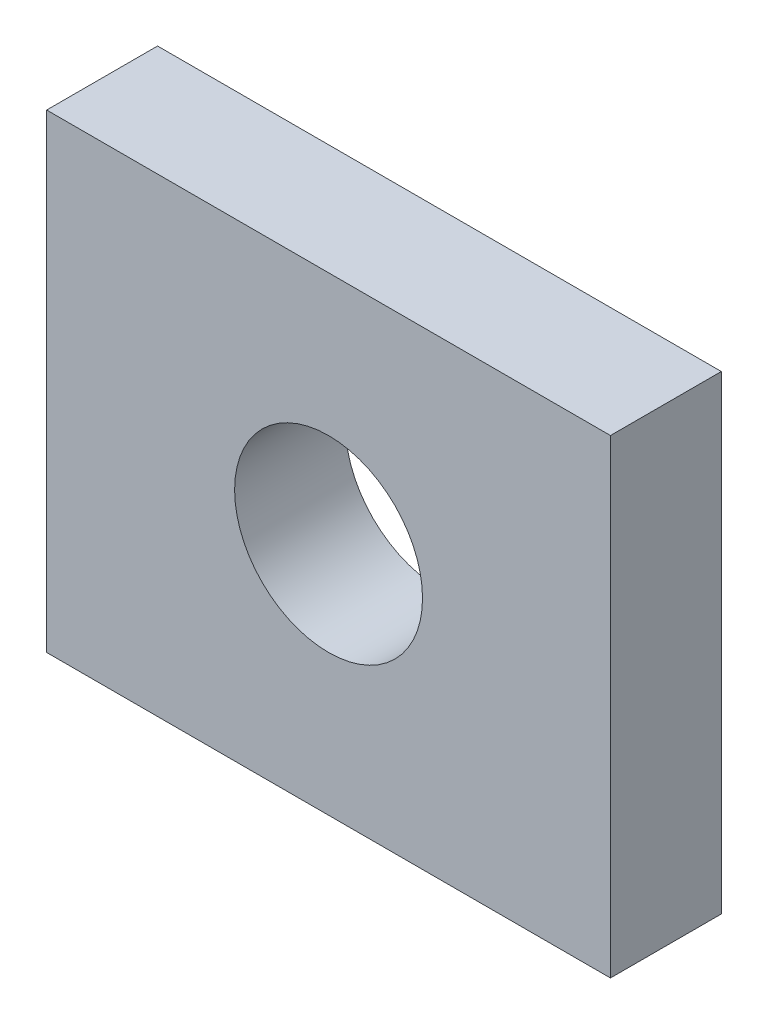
ISO-10303-21;
HEADER;
FILE_DESCRIPTION(('STEP AP214'),'2;1');
FILE_NAME('part.step','',(''),(''),'','','');
FILE_SCHEMA(('AUTOMOTIVE_DESIGN { 1 0 10303 214 1 1 1 1 }'));
ENDSEC;
DATA;
#1=APPLICATION_CONTEXT('core data for automotive mechanical design processes');
#2=APPLICATION_PROTOCOL_DEFINITION('international standard','automotive_design',2000,#1);
#3=PRODUCT_CONTEXT('',#1,'mechanical');
#4=PRODUCT('Part','Part','',(#3));
#5=PRODUCT_RELATED_PRODUCT_CATEGORY('part','',(#4));
#6=PRODUCT_DEFINITION_FORMATION('','',#4);
#7=PRODUCT_DEFINITION_CONTEXT('part definition',#1,'design');
#8=PRODUCT_DEFINITION('design','',#6,#7);
#9=PRODUCT_DEFINITION_SHAPE('','',#8);
#10=(LENGTH_UNIT() NAMED_UNIT(*) SI_UNIT(.MILLI.,.METRE.));
#11=(NAMED_UNIT(*) PLANE_ANGLE_UNIT() SI_UNIT($,.RADIAN.));
#12=(NAMED_UNIT(*) SI_UNIT($,.STERADIAN.) SOLID_ANGLE_UNIT());
#13=UNCERTAINTY_MEASURE_WITH_UNIT(LENGTH_MEASURE(1.E-05),#10,'distance_accuracy_value','');
#14=(GEOMETRIC_REPRESENTATION_CONTEXT(3) GLOBAL_UNCERTAINTY_ASSIGNED_CONTEXT((#13)) GLOBAL_UNIT_ASSIGNED_CONTEXT((#10,
#11,#12)) REPRESENTATION_CONTEXT('',''));
#15=CARTESIAN_POINT('',(0.,0.,0.));
#16=DIRECTION('',(0.,0.,1.));
#17=DIRECTION('',(1.,0.,0.));
#18=AXIS2_PLACEMENT_3D('',#15,#16,#17);
#19=CARTESIAN_POINT('',(0.,0.,2.9972));
#20=DIRECTION('',(0.,0.,-1.));
#21=DIRECTION('',(-1.,0.,0.));
#22=AXIS2_PLACEMENT_3D('',#19,#20,#21);
#23=PLANE('',#22);
#24=DIRECTION('',(0.,-1.,0.));
#25=VECTOR('',#24,1.);
#26=CARTESIAN_POINT('',(0.,0.,2.9972));
#27=LINE('',#26,#25);
#28=CARTESIAN_POINT('',(0.,12.7,2.9972));
#29=VERTEX_POINT('',#28);
#30=CARTESIAN_POINT('',(0.,0.,2.9972));
#31=VERTEX_POINT('',#30);
#32=EDGE_CURVE('E85',#29,#31,#27,.T.);
#33=ORIENTED_EDGE('',*,*,#32,.T.);
#34=DIRECTION('',(1.,0.,0.));
#35=VECTOR('',#34,1.);
#36=CARTESIAN_POINT('',(0.,0.,2.9972));
#37=LINE('',#36,#35);
#38=CARTESIAN_POINT('',(15.24,0.,2.9972));
#39=VERTEX_POINT('',#38);
#40=EDGE_CURVE('E80',#31,#39,#37,.T.);
#41=ORIENTED_EDGE('',*,*,#40,.T.);
#42=DIRECTION('',(0.,1.,0.));
#43=VECTOR('',#42,1.);
#44=CARTESIAN_POINT('',(15.24,0.,2.9972));
#45=LINE('',#44,#43);
#46=CARTESIAN_POINT('',(15.24,12.7,2.9972));
#47=VERTEX_POINT('',#46);
#48=EDGE_CURVE('E83',#39,#47,#45,.T.);
#49=ORIENTED_EDGE('',*,*,#48,.T.);
#50=DIRECTION('',(-1.,0.,0.));
#51=VECTOR('',#50,1.);
#52=CARTESIAN_POINT('',(0.,12.7,2.9972));
#53=LINE('',#52,#51);
#54=EDGE_CURVE('E50',#47,#29,#53,.T.);
#55=ORIENTED_EDGE('',*,*,#54,.T.);
#56=EDGE_LOOP('',(#33,#41,#49,#55));
#57=FACE_BOUND('',#56,.T.);
#58=CARTESIAN_POINT('',(7.62,6.35,2.9972));
#59=DIRECTION('',(0.,0.,1.));
#60=DIRECTION('',(1.,0.,0.));
#61=AXIS2_PLACEMENT_3D('',#58,#59,#60);
#62=CIRCLE('',#61,2.54);
#63=CARTESIAN_POINT('',(5.08,6.35,2.9972));
#64=VERTEX_POINT('',#63);
#65=EDGE_CURVE('E100',#64,#64,#62,.T.);
#66=ORIENTED_EDGE('',*,*,#65,.F.);
#67=EDGE_LOOP('',(#66));
#68=FACE_BOUND('',#67,.T.);
#69=ADVANCED_FACE('F33',(#57,#68),#23,.F.);
#70=CARTESIAN_POINT('',(0.,0.,0.));
#71=DIRECTION('',(0.,0.,-1.));
#72=DIRECTION('',(-1.,0.,0.));
#73=AXIS2_PLACEMENT_3D('',#70,#71,#72);
#74=PLANE('',#73);
#75=DIRECTION('',(0.,-1.,0.));
#76=VECTOR('',#75,1.);
#77=CARTESIAN_POINT('',(0.,0.,0.));
#78=LINE('',#77,#76);
#79=CARTESIAN_POINT('',(0.,12.7,0.));
#80=VERTEX_POINT('',#79);
#81=CARTESIAN_POINT('',(0.,0.,0.));
#82=VERTEX_POINT('',#81);
#83=EDGE_CURVE('E97',#80,#82,#78,.T.);
#84=ORIENTED_EDGE('',*,*,#83,.F.);
#85=DIRECTION('',(-1.,0.,0.));
#86=VECTOR('',#85,1.);
#87=CARTESIAN_POINT('',(0.,12.7,0.));
#88=LINE('',#87,#86);
#89=CARTESIAN_POINT('',(15.24,12.7,0.));
#90=VERTEX_POINT('',#89);
#91=EDGE_CURVE('E73',#90,#80,#88,.T.);
#92=ORIENTED_EDGE('',*,*,#91,.F.);
#93=DIRECTION('',(0.,1.,0.));
#94=VECTOR('',#93,1.);
#95=CARTESIAN_POINT('',(15.24,0.,0.));
#96=LINE('',#95,#94);
#97=CARTESIAN_POINT('',(15.24,0.,0.));
#98=VERTEX_POINT('',#97);
#99=EDGE_CURVE('E67',#98,#90,#96,.T.);
#100=ORIENTED_EDGE('',*,*,#99,.F.);
#101=DIRECTION('',(1.,0.,0.));
#102=VECTOR('',#101,1.);
#103=CARTESIAN_POINT('',(0.,0.,0.));
#104=LINE('',#103,#102);
#105=EDGE_CURVE('E89',#82,#98,#104,.T.);
#106=ORIENTED_EDGE('',*,*,#105,.F.);
#107=EDGE_LOOP('',(#84,#92,#100,#106));
#108=FACE_BOUND('',#107,.T.);
#109=CARTESIAN_POINT('',(7.62,6.35,0.));
#110=DIRECTION('',(0.,0.,1.));
#111=DIRECTION('',(1.,0.,0.));
#112=AXIS2_PLACEMENT_3D('',#109,#110,#111);
#113=CIRCLE('',#112,2.54);
#114=CARTESIAN_POINT('',(5.08,6.35,0.));
#115=VERTEX_POINT('',#114);
#116=EDGE_CURVE('E112',#115,#115,#113,.T.);
#117=ORIENTED_EDGE('',*,*,#116,.T.);
#118=EDGE_LOOP('',(#117));
#119=FACE_BOUND('',#118,.T.);
#120=ADVANCED_FACE('F108',(#108,#119),#74,.T.);
#121=CARTESIAN_POINT('',(0.,0.,2.9972));
#122=DIRECTION('',(1.,0.,0.));
#123=DIRECTION('',(0.,0.,-1.));
#124=AXIS2_PLACEMENT_3D('',#121,#122,#123);
#125=PLANE('',#124);
#126=ORIENTED_EDGE('',*,*,#83,.T.);
#127=DIRECTION('',(0.,0.,-1.));
#128=VECTOR('',#127,1.);
#129=CARTESIAN_POINT('',(0.,0.,2.9972));
#130=LINE('',#129,#128);
#131=EDGE_CURVE('E11',#31,#82,#130,.T.);
#132=ORIENTED_EDGE('',*,*,#131,.F.);
#133=ORIENTED_EDGE('',*,*,#32,.F.);
#134=DIRECTION('',(0.,0.,-1.));
#135=VECTOR('',#134,1.);
#136=CARTESIAN_POINT('',(0.,12.7,2.9972));
#137=LINE('',#136,#135);
#138=EDGE_CURVE('E93',#29,#80,#137,.T.);
#139=ORIENTED_EDGE('',*,*,#138,.T.);
#140=EDGE_LOOP('',(#126,#132,#133,#139));
#141=FACE_BOUND('',#140,.T.);
#142=ADVANCED_FACE('F35',(#141),#125,.F.);
#143=CARTESIAN_POINT('',(0.,0.,2.9972));
#144=DIRECTION('',(0.,1.,0.));
#145=DIRECTION('',(0.,0.,1.));
#146=AXIS2_PLACEMENT_3D('',#143,#144,#145);
#147=PLANE('',#146);
#148=ORIENTED_EDGE('',*,*,#105,.T.);
#149=DIRECTION('',(0.,0.,-1.));
#150=VECTOR('',#149,1.);
#151=CARTESIAN_POINT('',(15.24,0.,2.9972));
#152=LINE('',#151,#150);
#153=EDGE_CURVE('E42',#39,#98,#152,.T.);
#154=ORIENTED_EDGE('',*,*,#153,.F.);
#155=ORIENTED_EDGE('',*,*,#40,.F.);
#156=ORIENTED_EDGE('',*,*,#131,.T.);
#157=EDGE_LOOP('',(#148,#154,#155,#156));
#158=FACE_BOUND('',#157,.T.);
#159=ADVANCED_FACE('F88',(#158),#147,.F.);
#160=CARTESIAN_POINT('',(15.24,0.,2.9972));
#161=DIRECTION('',(-1.,0.,0.));
#162=DIRECTION('',(0.,0.,1.));
#163=AXIS2_PLACEMENT_3D('',#160,#161,#162);
#164=PLANE('',#163);
#165=ORIENTED_EDGE('',*,*,#99,.T.);
#166=DIRECTION('',(0.,0.,-1.));
#167=VECTOR('',#166,1.);
#168=CARTESIAN_POINT('',(15.24,12.7,2.9972));
#169=LINE('',#168,#167);
#170=EDGE_CURVE('E90',#47,#90,#169,.T.);
#171=ORIENTED_EDGE('',*,*,#170,.F.);
#172=ORIENTED_EDGE('',*,*,#48,.F.);
#173=ORIENTED_EDGE('',*,*,#153,.T.);
#174=EDGE_LOOP('',(#165,#171,#172,#173));
#175=FACE_BOUND('',#174,.T.);
#176=ADVANCED_FACE('F91',(#175),#164,.F.);
#177=CARTESIAN_POINT('',(0.,12.7,2.9972));
#178=DIRECTION('',(0.,-1.,0.));
#179=DIRECTION('',(0.,0.,-1.));
#180=AXIS2_PLACEMENT_3D('',#177,#178,#179);
#181=PLANE('',#180);
#182=ORIENTED_EDGE('',*,*,#91,.T.);
#183=ORIENTED_EDGE('',*,*,#138,.F.);
#184=ORIENTED_EDGE('',*,*,#54,.F.);
#185=ORIENTED_EDGE('',*,*,#170,.T.);
#186=EDGE_LOOP('',(#182,#183,#184,#185));
#187=FACE_BOUND('',#186,.T.);
#188=ADVANCED_FACE('F105',(#187),#181,.F.);
#189=CARTESIAN_POINT('',(7.62,6.35,2.9972));
#190=DIRECTION('',(0.,0.,-1.));
#191=DIRECTION('',(-1.,0.,0.));
#192=AXIS2_PLACEMENT_3D('',#189,#190,#191);
#193=CYLINDRICAL_SURFACE('',#192,2.54);
#194=CARTESIAN_POINT('',(5.08,6.35,2.9972));
#195=CARTESIAN_POINT('',(5.08,6.35,2.96597916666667));
#196=CARTESIAN_POINT('',(5.08,6.35,2.93475833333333));
#197=CARTESIAN_POINT('',(5.08,6.35,2.87231666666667));
#198=CARTESIAN_POINT('',(5.08,6.35,2.84109583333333));
#199=CARTESIAN_POINT('',(5.08,6.35,2.77865416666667));
#200=CARTESIAN_POINT('',(5.08,6.35,2.74743333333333));
#201=CARTESIAN_POINT('',(5.08,6.35,2.68499166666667));
#202=CARTESIAN_POINT('',(5.08,6.35,2.65377083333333));
#203=CARTESIAN_POINT('',(5.08,6.35,2.59132916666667));
#204=CARTESIAN_POINT('',(5.08,6.35,2.56010833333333));
#205=CARTESIAN_POINT('',(5.08,6.35,2.49766666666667));
#206=CARTESIAN_POINT('',(5.08,6.35,2.46644583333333));
#207=CARTESIAN_POINT('',(5.08,6.35,2.40400416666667));
#208=CARTESIAN_POINT('',(5.08,6.35,2.37278333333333));
#209=CARTESIAN_POINT('',(5.08,6.35,2.31034166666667));
#210=CARTESIAN_POINT('',(5.08,6.35,2.27912083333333));
#211=CARTESIAN_POINT('',(5.08,6.35,2.21667916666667));
#212=CARTESIAN_POINT('',(5.08,6.35,2.18545833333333));
#213=CARTESIAN_POINT('',(5.08,6.35,2.12301666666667));
#214=CARTESIAN_POINT('',(5.08,6.35,2.09179583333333));
#215=CARTESIAN_POINT('',(5.08,6.35,2.02935416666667));
#216=CARTESIAN_POINT('',(5.08,6.35,1.99813333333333));
#217=CARTESIAN_POINT('',(5.08,6.35,1.93569166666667));
#218=CARTESIAN_POINT('',(5.08,6.35,1.90447083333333));
#219=CARTESIAN_POINT('',(5.08,6.35,1.84202916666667));
#220=CARTESIAN_POINT('',(5.08,6.35,1.81080833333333));
#221=CARTESIAN_POINT('',(5.08,6.35,1.74836666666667));
#222=CARTESIAN_POINT('',(5.08,6.35,1.71714583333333));
#223=CARTESIAN_POINT('',(5.08,6.35,1.65470416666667));
#224=CARTESIAN_POINT('',(5.08,6.35,1.62348333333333));
#225=CARTESIAN_POINT('',(5.08,6.35,1.56104166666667));
#226=CARTESIAN_POINT('',(5.08,6.35,1.52982083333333));
#227=CARTESIAN_POINT('',(5.08,6.35,1.46737916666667));
#228=CARTESIAN_POINT('',(5.08,6.35,1.43615833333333));
#229=CARTESIAN_POINT('',(5.08,6.35,1.37371666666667));
#230=CARTESIAN_POINT('',(5.08,6.35,1.34249583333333));
#231=CARTESIAN_POINT('',(5.08,6.35,1.28005416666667));
#232=CARTESIAN_POINT('',(5.08,6.35,1.24883333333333));
#233=CARTESIAN_POINT('',(5.08,6.35,1.18639166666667));
#234=CARTESIAN_POINT('',(5.08,6.35,1.15517083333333));
#235=CARTESIAN_POINT('',(5.08,6.35,1.09272916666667));
#236=CARTESIAN_POINT('',(5.08,6.35,1.06150833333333));
#237=CARTESIAN_POINT('',(5.08,6.35,0.999066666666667));
#238=CARTESIAN_POINT('',(5.08,6.35,0.967845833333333));
#239=CARTESIAN_POINT('',(5.08,6.35,0.905404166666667));
#240=CARTESIAN_POINT('',(5.08,6.35,0.874183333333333));
#241=CARTESIAN_POINT('',(5.08,6.35,0.811741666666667));
#242=CARTESIAN_POINT('',(5.08,6.35,0.780520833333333));
#243=CARTESIAN_POINT('',(5.08,6.35,0.718079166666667));
#244=CARTESIAN_POINT('',(5.08,6.35,0.686858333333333));
#245=CARTESIAN_POINT('',(5.08,6.35,0.624416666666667));
#246=CARTESIAN_POINT('',(5.08,6.35,0.593195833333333));
#247=CARTESIAN_POINT('',(5.08,6.35,0.530754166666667));
#248=CARTESIAN_POINT('',(5.08,6.35,0.499533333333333));
#249=CARTESIAN_POINT('',(5.08,6.35,0.437091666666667));
#250=CARTESIAN_POINT('',(5.08,6.35,0.405870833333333));
#251=CARTESIAN_POINT('',(5.08,6.35,0.343429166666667));
#252=CARTESIAN_POINT('',(5.08,6.35,0.312208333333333));
#253=CARTESIAN_POINT('',(5.08,6.35,0.249766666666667));
#254=CARTESIAN_POINT('',(5.08,6.35,0.218545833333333));
#255=CARTESIAN_POINT('',(5.08,6.35,0.156104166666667));
#256=CARTESIAN_POINT('',(5.08,6.35,0.124883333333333));
#257=CARTESIAN_POINT('',(5.08,6.35,0.0624416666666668));
#258=CARTESIAN_POINT('',(5.08,6.35,0.0312208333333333));
#259=CARTESIAN_POINT('',(5.08,6.35,0.));
#260=B_SPLINE_CURVE_WITH_KNOTS('',3,(#194,#195,#196,#197,#198,#199,#200,#201,#202,#203,#204,
#205,#206,#207,#208,#209,#210,#211,#212,#213,#214,#215,#216,#217,#218,#219,#220,#221,#222,#223,
#224,#225,#226,#227,#228,#229,#230,#231,#232,#233,#234,#235,#236,#237,#238,#239,#240,#241,#242,
#243,#244,#245,#246,#247,#248,#249,#250,#251,#252,#253,#254,#255,#256,#257,#258,#259),
.UNSPECIFIED.,.F.,.F.,(4,2,2,2,2,2,2,2,2,2,2,2,2,2,2,2,2,2,2,2,2,2,2,2,2,2,2,2,2,2,2,2,4),(0.,
0.0936625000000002,0.187325,0.2809875,0.37465,0.4683125,0.561975,0.6556375,0.7493,0.8429625,
0.936625,1.0302875,1.12395,1.2176125,1.311275,1.4049375,1.4986,1.5922625,1.685925,1.7795875,
1.87325,1.9669125,2.060575,2.1542375,2.2479,2.3415625,2.435225,2.5288875,2.62255,2.7162125,
2.809875,2.9035375,2.9972),.UNSPECIFIED.);
#261=EDGE_CURVE('BSEAM118',#64,#115,#260,.T.);
#262=ORIENTED_EDGE('',*,*,#65,.T.);
#263=ORIENTED_EDGE('',*,*,#116,.F.);
#264=ORIENTED_EDGE('',*,*,#261,.T.);
#265=ORIENTED_EDGE('',*,*,#261,.F.);
#266=EDGE_LOOP('',(#262,#264,#263,#265));
#267=FACE_BOUND('',#266,.T.);
#268=ADVANCED_FACE('F118',(#267),#193,.F.);
#269=CLOSED_SHELL('',(#69,#120,#142,#159,#176,#188,#268));
#270=MANIFOLD_SOLID_BREP('B2',#269);
#271=ADVANCED_BREP_SHAPE_REPRESENTATION('',(#18,#270),#14);
#272=SHAPE_DEFINITION_REPRESENTATION(#9,#271);
ENDSEC;
END-ISO-10303-21;
